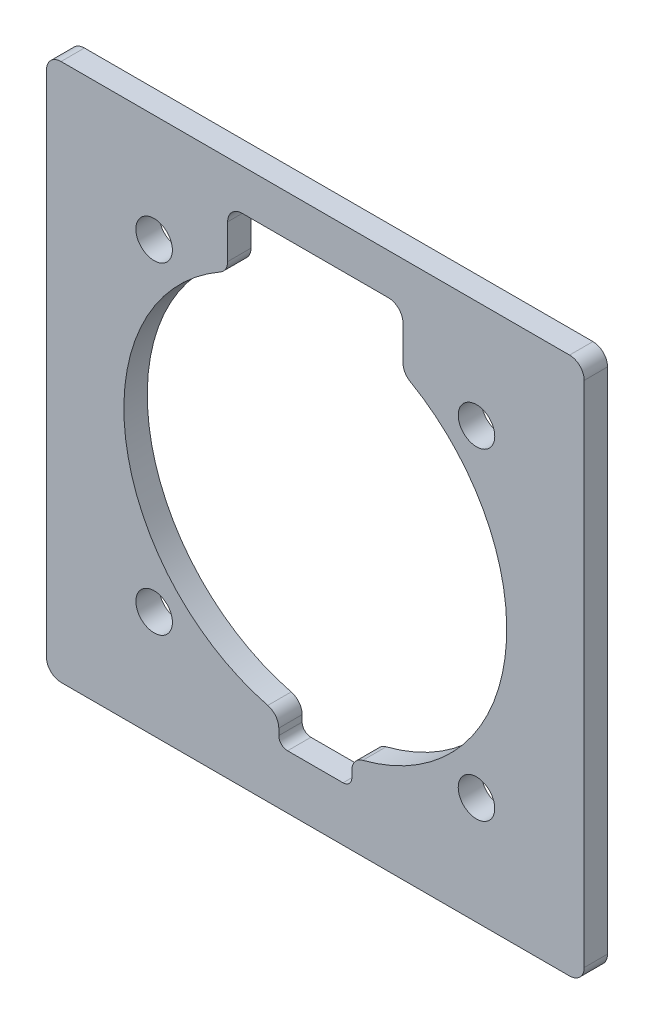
from build123d import *

# Parameters (mm, degrees)
ESQUISSE1_R      = 6.25
EXTRUSION1_DEPTH = 8


with BuildPart() as part:
    # Esquisse1 → Extrusion1 (new body)
    with BuildSketch(Plane.XY):
        with BuildLine():
            Line((-92, 87), (-92, -87))
            ThreePointArc((-92, -87), (-90.535533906, -90.535533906), (-87, -92))
            Line((-87, -92), (87, -92))
            ThreePointArc((87, -92), (90.535533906, -90.535533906), (92, -87))
            Line((92, -87), (92, 87))
            ThreePointArc((92, 87), (90.535533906, 90.535533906), (87, 92))
            Line((87, 92), (-87, 92))
            ThreePointArc((-87, 92), (-90.535533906, 90.535533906), (-92, 87))
        make_face()
        with Locations(Location((-55.15, 55.15, 0), (0, 0, 180))):
            Circle(ESQUISSE1_R, mode=Mode.SUBTRACT)
        with Locations((-55.15, -55.15)):
            Circle(ESQUISSE1_R, mode=Mode.SUBTRACT)
        with Locations(Location((55.15, -55.15, 0), (0, 0, 180))):
            Circle(ESQUISSE1_R, mode=Mode.SUBTRACT)
        with Locations((55.15, 55.15)):
            Circle(ESQUISSE1_R, mode=Mode.SUBTRACT)
        with BuildLine():
            Line((25, 78), (-25, 78))
            ThreePointArc((-25, 78), (-28.535533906, 76.535533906), (-30, 73))
            Line((-30, 73), (-30, 61.198447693))
            ThreePointArc((-30, 61.198447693), (-30.674994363, 58.689598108), (-32.517730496, 56.858132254))
            ThreePointArc((-32.517730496, 56.858132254), (-64.909931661, -8.772158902), (-16.258865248, -63.44997479))
            ThreePointArc((-16.258865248, -63.44997479), (-13.549957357, -65.228005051), (-12.5, -68.293484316))
            Line((-12.5, -68.293484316), (-12.5, -70.5))
            ThreePointArc((-12.5, -70.5), (-11.621320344, -72.621320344), (-9.5, -73.5))
            Line((-9.5, -73.5), (9.5, -73.5))
            ThreePointArc((9.5, -73.5), (11.621320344, -72.621320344), (12.5, -70.5))
            Line((12.5, -70.5), (12.5, -68.293484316))
            ThreePointArc((12.5, -68.293484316), (13.549957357, -65.228005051), (16.258865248, -63.44997479))
            ThreePointArc((16.258865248, -63.44997479), (64.909931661, -8.772158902), (32.517730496, 56.858132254))
            ThreePointArc((32.517730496, 56.858132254), (30.674994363, 58.689598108), (30, 61.198447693))
            Line((30, 61.198447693), (30, 73))
            ThreePointArc((30, 73), (28.535533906, 76.535533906), (25, 78))
        make_face(mode=Mode.SUBTRACT)
    extrude(amount=EXTRUSION1_DEPTH)


solid = part.part
